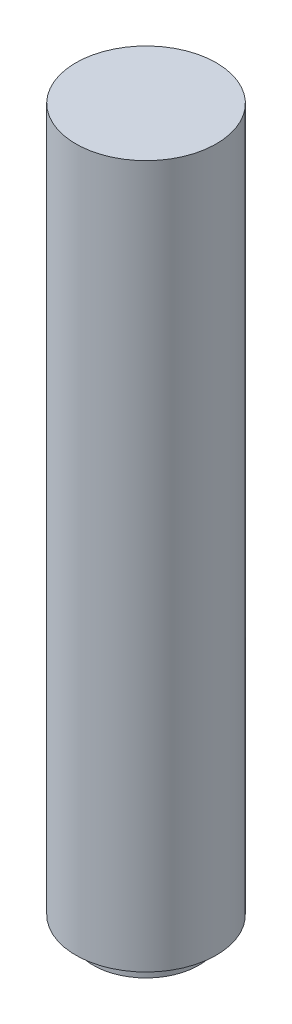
ISO-10303-21;
HEADER;
FILE_DESCRIPTION(('STEP AP214'),'2;1');
FILE_NAME('part.step','',(''),(''),'','','');
FILE_SCHEMA(('AUTOMOTIVE_DESIGN { 1 0 10303 214 1 1 1 1 }'));
ENDSEC;
DATA;
#1=APPLICATION_CONTEXT('core data for automotive mechanical design processes');
#2=APPLICATION_PROTOCOL_DEFINITION('international standard','automotive_design',2000,#1);
#3=PRODUCT_CONTEXT('',#1,'mechanical');
#4=PRODUCT('Part','Part','',(#3));
#5=PRODUCT_RELATED_PRODUCT_CATEGORY('part','',(#4));
#6=PRODUCT_DEFINITION_FORMATION('','',#4);
#7=PRODUCT_DEFINITION_CONTEXT('part definition',#1,'design');
#8=PRODUCT_DEFINITION('design','',#6,#7);
#9=PRODUCT_DEFINITION_SHAPE('','',#8);
#10=(LENGTH_UNIT() NAMED_UNIT(*) SI_UNIT(.MILLI.,.METRE.));
#11=(NAMED_UNIT(*) PLANE_ANGLE_UNIT() SI_UNIT($,.RADIAN.));
#12=(NAMED_UNIT(*) SI_UNIT($,.STERADIAN.) SOLID_ANGLE_UNIT());
#13=UNCERTAINTY_MEASURE_WITH_UNIT(LENGTH_MEASURE(1.E-05),#10,'distance_accuracy_value','');
#14=(GEOMETRIC_REPRESENTATION_CONTEXT(3) GLOBAL_UNCERTAINTY_ASSIGNED_CONTEXT((#13)) GLOBAL_UNIT_ASSIGNED_CONTEXT((#10,
#11,#12)) REPRESENTATION_CONTEXT('',''));
#15=CARTESIAN_POINT('',(0.,0.,0.));
#16=DIRECTION('',(0.,0.,1.));
#17=DIRECTION('',(1.,0.,0.));
#18=AXIS2_PLACEMENT_3D('',#15,#16,#17);
#19=CARTESIAN_POINT('',(0.,0.,0.));
#20=DIRECTION('',(0.,-1.,0.));
#21=DIRECTION('',(0.,0.,-1.));
#22=AXIS2_PLACEMENT_3D('',#19,#20,#21);
#23=PLANE('',#22);
#24=CARTESIAN_POINT('',(0.,0.,0.));
#25=DIRECTION('',(0.,-1.,0.));
#26=DIRECTION('',(0.,0.,-1.));
#27=AXIS2_PLACEMENT_3D('',#24,#25,#26);
#28=CIRCLE('',#27,3.);
#29=CARTESIAN_POINT('',(0.,0.,-3.));
#30=VERTEX_POINT('',#29);
#31=EDGE_CURVE('E10',#30,#30,#28,.T.);
#32=ORIENTED_EDGE('',*,*,#31,.T.);
#33=EDGE_LOOP('',(#32));
#34=FACE_BOUND('',#33,.T.);
#35=ADVANCED_FACE('F14',(#34),#23,.T.);
#36=CARTESIAN_POINT('',(0.,0.,0.));
#37=DIRECTION('',(0.,-1.,0.));
#38=DIRECTION('',(0.,0.,-1.));
#39=AXIS2_PLACEMENT_3D('',#36,#37,#38);
#40=CYLINDRICAL_SURFACE('',#39,3.);
#41=CARTESIAN_POINT('',(0.,1.,0.));
#42=DIRECTION('',(0.,-1.,0.));
#43=DIRECTION('',(0.,0.,-1.));
#44=AXIS2_PLACEMENT_3D('',#41,#42,#43);
#45=CIRCLE('',#44,3.);
#46=CARTESIAN_POINT('',(0.,1.,-3.));
#47=VERTEX_POINT('',#46);
#48=EDGE_CURVE('E20',#47,#47,#45,.T.);
#49=ORIENTED_EDGE('',*,*,#48,.T.);
#50=EDGE_LOOP('',(#49));
#51=FACE_BOUND('',#50,.T.);
#52=ORIENTED_EDGE('',*,*,#31,.F.);
#53=EDGE_LOOP('',(#52));
#54=FACE_BOUND('',#53,.T.);
#55=ADVANCED_FACE('F48',(#51,#54),#40,.T.);
#56=CARTESIAN_POINT('',(3.,1.,0.));
#57=DIRECTION('',(0.,-1.,0.));
#58=DIRECTION('',(0.,0.,-1.));
#59=AXIS2_PLACEMENT_3D('',#56,#57,#58);
#60=PLANE('',#59);
#61=CARTESIAN_POINT('',(0.,1.,0.));
#62=DIRECTION('',(0.,-1.,0.));
#63=DIRECTION('',(0.,0.,-1.));
#64=AXIS2_PLACEMENT_3D('',#61,#62,#63);
#65=CIRCLE('',#64,4.);
#66=CARTESIAN_POINT('',(0.,1.,-4.));
#67=VERTEX_POINT('',#66);
#68=EDGE_CURVE('E24',#67,#67,#65,.T.);
#69=ORIENTED_EDGE('',*,*,#68,.T.);
#70=EDGE_LOOP('',(#69));
#71=FACE_BOUND('',#70,.T.);
#72=ORIENTED_EDGE('',*,*,#48,.F.);
#73=EDGE_LOOP('',(#72));
#74=FACE_BOUND('',#73,.T.);
#75=ADVANCED_FACE('F45',(#71,#74),#60,.T.);
#76=CARTESIAN_POINT('',(0.,0.,0.));
#77=DIRECTION('',(0.,-1.,0.));
#78=DIRECTION('',(0.,0.,-1.));
#79=AXIS2_PLACEMENT_3D('',#76,#77,#78);
#80=CYLINDRICAL_SURFACE('',#79,4.);
#81=CARTESIAN_POINT('',(0.,41.,0.));
#82=DIRECTION('',(0.,-1.,0.));
#83=DIRECTION('',(0.,0.,-1.));
#84=AXIS2_PLACEMENT_3D('',#81,#82,#83);
#85=CIRCLE('',#84,4.);
#86=CARTESIAN_POINT('',(0.,41.,-4.));
#87=VERTEX_POINT('',#86);
#88=EDGE_CURVE('E28',#87,#87,#85,.T.);
#89=ORIENTED_EDGE('',*,*,#88,.T.);
#90=EDGE_LOOP('',(#89));
#91=FACE_BOUND('',#90,.T.);
#92=ORIENTED_EDGE('',*,*,#68,.F.);
#93=EDGE_LOOP('',(#92));
#94=FACE_BOUND('',#93,.T.);
#95=ADVANCED_FACE('F34',(#91,#94),#80,.T.);
#96=CARTESIAN_POINT('',(4.,41.,0.));
#97=DIRECTION('',(0.,1.,0.));
#98=DIRECTION('',(0.,0.,1.));
#99=AXIS2_PLACEMENT_3D('',#96,#97,#98);
#100=PLANE('',#99);
#101=ORIENTED_EDGE('',*,*,#88,.F.);
#102=EDGE_LOOP('',(#101));
#103=FACE_BOUND('',#102,.T.);
#104=ADVANCED_FACE('F37',(#103),#100,.T.);
#105=CLOSED_SHELL('',(#35,#55,#75,#95,#104));
#106=MANIFOLD_SOLID_BREP('B1',#105);
#107=ADVANCED_BREP_SHAPE_REPRESENTATION('',(#18,#106),#14);
#108=SHAPE_DEFINITION_REPRESENTATION(#9,#107);
ENDSEC;
END-ISO-10303-21;
